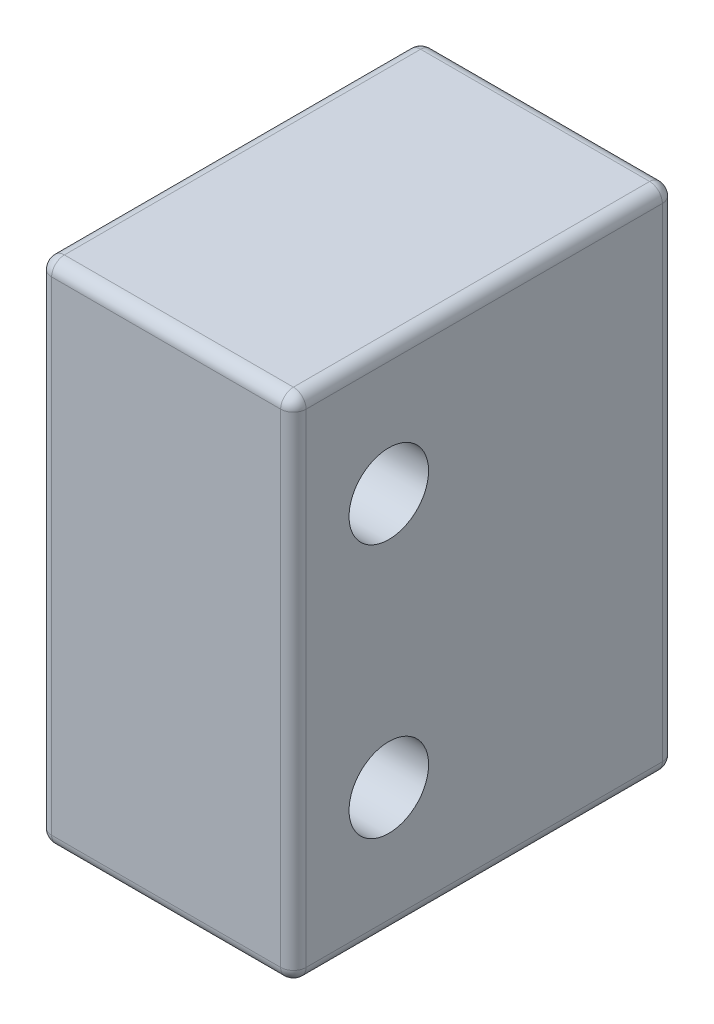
from build123d import *

# Parameters (mm, degrees)
SKETCH1_W          = 76.2
SKETCH1_H          = 101.6
EXTRUDE1_DEPTH     = 50.8
SKETCH2_R          = 7.9375
CUT_EXTRUDE1_DEPTH = 25.4
FILLET1_R          = 2.54
SKETCH3_R          = 7.9375
CUT_EXTRUDE3_DEPTH = 12.7


with BuildPart() as part:
    # Sketch1 → Extrude1 (new body)
    with BuildSketch(Plane(origin=(0, 0, 0), x_dir=(0, 0, -1), z_dir=(1, 0, 0))):
        Rectangle(SKETCH1_W, SKETCH1_H)
    extrude(amount=EXTRUDE1_DEPTH)

    # Sketch2 → Cut-Extrude1 (cut)
    with BuildSketch(Plane(origin=(50.8, 0, 0), x_dir=(0, 0, -1), z_dir=(1, 0, 0))):
        with Locations((-19.05, 25.4)):
            Circle(SKETCH2_R)
        with Locations((-19.05, -25.4)):
            Circle(SKETCH2_R)
    extrude(amount=-CUT_EXTRUDE1_DEPTH, mode=Mode.SUBTRACT)

    # Fillet1
    fillet1_edges = [part.edges().sort_by_distance(p)[0] for p in [
        (50.8, 0, -38.1),
        (50.8, 50.8, 0),
        (50.8, 0, 38.1),
        (0, 50.8, 0),
        (0, 0, -38.1),
        (0, -50.8, 0),
        (0, 0, 38.1),
        (50.8, -50.8, 0),
        (25.4, 50.8, 38.1),
        (25.4, 50.8, -38.1),
        (25.4, -50.8, -38.1),
        (25.4, -50.8, 38.1),
    ]]
    fillet(fillet1_edges, radius=FILLET1_R)

    # Sketch3 → Cut-Extrude3 (cut)
    with BuildSketch(Plane.XZ.offset(50.8)):
        with Locations(Location((25.4, 16.51, 0), (0, 0, 270))):
            Circle(SKETCH3_R)
    extrude(amount=-CUT_EXTRUDE3_DEPTH, mode=Mode.SUBTRACT)


solid = part.part
